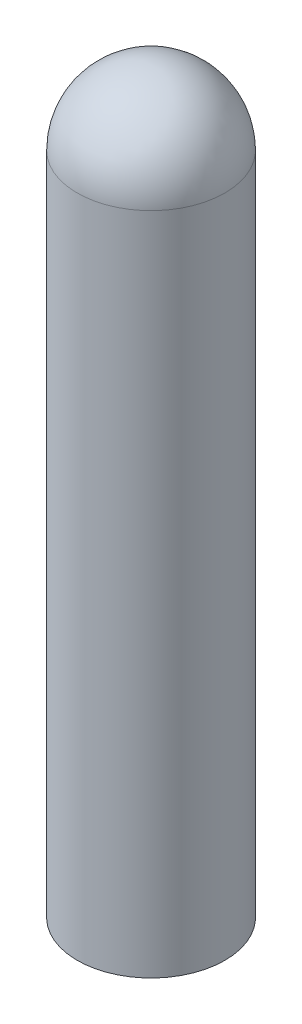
ISO-10303-21;
HEADER;
FILE_DESCRIPTION(('STEP AP214'),'2;1');
FILE_NAME('part.step','',(''),(''),'','','');
FILE_SCHEMA(('AUTOMOTIVE_DESIGN { 1 0 10303 214 1 1 1 1 }'));
ENDSEC;
DATA;
#1=APPLICATION_CONTEXT('core data for automotive mechanical design processes');
#2=APPLICATION_PROTOCOL_DEFINITION('international standard','automotive_design',2000,#1);
#3=PRODUCT_CONTEXT('',#1,'mechanical');
#4=PRODUCT('Part','Part','',(#3));
#5=PRODUCT_RELATED_PRODUCT_CATEGORY('part','',(#4));
#6=PRODUCT_DEFINITION_FORMATION('','',#4);
#7=PRODUCT_DEFINITION_CONTEXT('part definition',#1,'design');
#8=PRODUCT_DEFINITION('design','',#6,#7);
#9=PRODUCT_DEFINITION_SHAPE('','',#8);
#10=(LENGTH_UNIT() NAMED_UNIT(*) SI_UNIT(.MILLI.,.METRE.));
#11=(NAMED_UNIT(*) PLANE_ANGLE_UNIT() SI_UNIT($,.RADIAN.));
#12=(NAMED_UNIT(*) SI_UNIT($,.STERADIAN.) SOLID_ANGLE_UNIT());
#13=UNCERTAINTY_MEASURE_WITH_UNIT(LENGTH_MEASURE(1.E-05),#10,'distance_accuracy_value','');
#14=(GEOMETRIC_REPRESENTATION_CONTEXT(3) GLOBAL_UNCERTAINTY_ASSIGNED_CONTEXT((#13)) GLOBAL_UNIT_ASSIGNED_CONTEXT((#10,
#11,#12)) REPRESENTATION_CONTEXT('',''));
#15=CARTESIAN_POINT('',(0.,0.,0.));
#16=DIRECTION('',(0.,0.,1.));
#17=DIRECTION('',(1.,0.,0.));
#18=AXIS2_PLACEMENT_3D('',#15,#16,#17);
#19=CARTESIAN_POINT('',(-67.66,14.925,0.));
#20=DIRECTION('',(0.,-1.,0.));
#21=DIRECTION('',(1.,0.,0.));
#22=AXIS2_PLACEMENT_3D('',#19,#20,#21);
#23=CYLINDRICAL_SURFACE('',#22,1.4925);
#24=CARTESIAN_POINT('',(-67.66,13.4325,0.));
#25=DIRECTION('',(0.,-1.,0.));
#26=DIRECTION('',(0.,0.,-1.));
#27=AXIS2_PLACEMENT_3D('',#24,#25,#26);
#28=CIRCLE('',#27,1.4925);
#29=CARTESIAN_POINT('',(-67.66,13.4325,-1.4925));
#30=VERTEX_POINT('',#29);
#31=EDGE_CURVE('E10',#30,#30,#28,.T.);
#32=ORIENTED_EDGE('',*,*,#31,.T.);
#33=EDGE_LOOP('',(#32));
#34=FACE_BOUND('',#33,.T.);
#35=CARTESIAN_POINT('',(-67.66,0.,0.));
#36=DIRECTION('',(0.,-1.,0.));
#37=DIRECTION('',(1.,0.,0.));
#38=AXIS2_PLACEMENT_3D('',#35,#36,#37);
#39=CIRCLE('',#38,1.4925);
#40=CARTESIAN_POINT('',(-66.1675,0.,0.));
#41=VERTEX_POINT('',#40);
#42=EDGE_CURVE('E21',#41,#41,#39,.T.);
#43=ORIENTED_EDGE('',*,*,#42,.F.);
#44=EDGE_LOOP('',(#43));
#45=FACE_BOUND('',#44,.T.);
#46=ADVANCED_FACE('F14',(#34,#45),#23,.T.);
#47=CARTESIAN_POINT('',(-67.66,0.,0.));
#48=DIRECTION('',(0.,-1.,0.));
#49=DIRECTION('',(1.,0.,0.));
#50=AXIS2_PLACEMENT_3D('',#47,#48,#49);
#51=PLANE('',#50);
#52=ORIENTED_EDGE('',*,*,#42,.T.);
#53=EDGE_LOOP('',(#52));
#54=FACE_BOUND('',#53,.T.);
#55=ADVANCED_FACE('F46',(#54),#51,.T.);
#56=CARTESIAN_POINT('',(-67.66,13.4325,0.));
#57=DIRECTION('',(0.,0.,1.));
#58=DIRECTION('',(1.,0.,0.));
#59=AXIS2_PLACEMENT_3D('',#56,#57,#58);
#60=SPHERICAL_SURFACE('',#59,1.4925);
#61=CARTESIAN_POINT('',(-67.66,13.4325,0.));
#62=DIRECTION('',(0.,-1.,0.));
#63=DIRECTION('',(0.,0.,-1.));
#64=AXIS2_PLACEMENT_3D('',#61,#62,#63);
#65=SPHERICAL_SURFACE('',#64,1.4925);
#66=ORIENTED_EDGE('',*,*,#31,.F.);
#67=EDGE_LOOP('',(#66));
#68=FACE_BOUND('',#67,.T.);
#69=ADVANCED_FACE('F54',(#68),#65,.T.);
#70=CLOSED_SHELL('',(#46,#55,#69));
#71=MANIFOLD_SOLID_BREP('B1',#70);
#72=ADVANCED_BREP_SHAPE_REPRESENTATION('',(#18,#71),#14);
#73=SHAPE_DEFINITION_REPRESENTATION(#9,#72);
ENDSEC;
END-ISO-10303-21;
